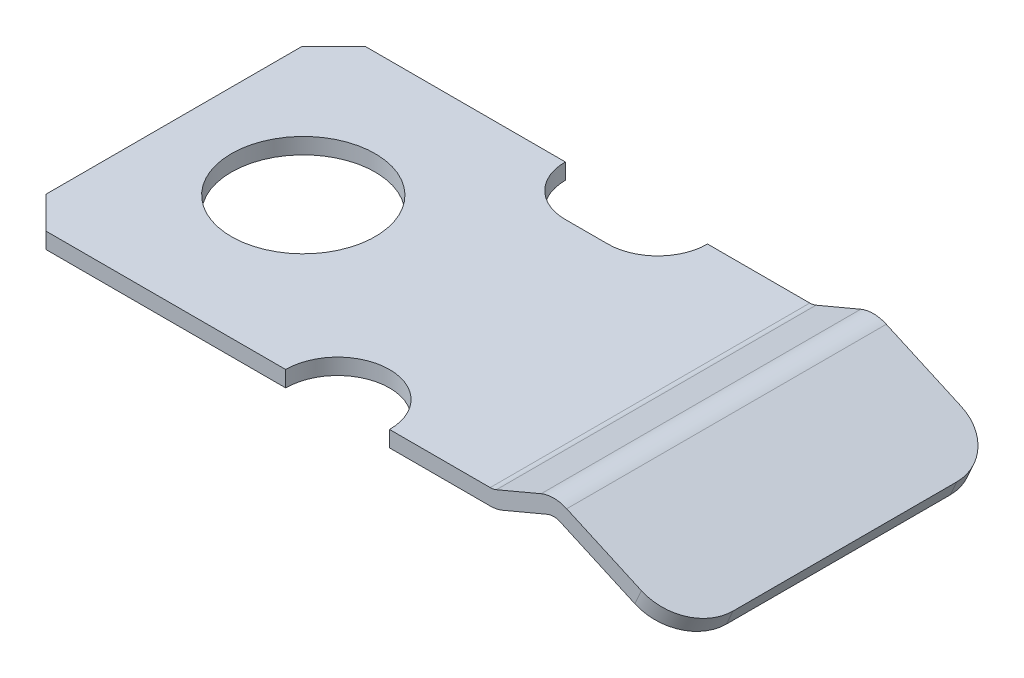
from build123d import *

# Parameters (mm, degrees)
EXTRUSION1_DEPTH        = 5
ESQUISSE2_R             = 2.25
ESQUISSE2_R_2           = 1.625
ENL_V_MAT_EXTRU_1_DEPTH = 10
CHANFREIN1_SIZE         = 1
CONG_1_R                = 1.5


with BuildPart() as part:
    # Esquisse1 → Extrusion1 (new, symmetric)
    with BuildSketch(Plane.XY):
        with BuildLine():
            Line((15.287694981, 0.078722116), (16.688265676, 0.669954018))
            ThreePointArc((16.688265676, 0.669954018), (16.888404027, 0.709282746), (17.0875962, 0.665412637))
            Line((17.0875962, 0.665412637), (20.795121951, -1))
            Line((20.795121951, -1), (21, -0.543902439))
            Line((21, -0.543902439), (17.292474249, 1.121510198))
            ThreePointArc((17.292474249, 1.121510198), (16.894089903, 1.209250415), (16.493813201, 1.13059296))
            Line((16.493813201, 1.13059296), (15.093242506, 0.539361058))
            ThreePointArc((15.093242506, 0.539361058), (14.997988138, 0.509939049), (14.898790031, 0.5))
            Line((14.898790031, 0.5), (0, 0.5))
            Line((0, 0.5), (0, 0))
            Line((0, 0), (14.898790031, 0))
            ThreePointArc((14.898790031, 0), (15.097186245, 0.019878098), (15.287694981, 0.078722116))
        make_face()
    extrude(amount=EXTRUSION1_DEPTH, both=True)

    # Esquisse2 → Enl_v. mat.-Extru.1 (cut)
    with BuildSketch(Plane(origin=(0, 0.5, 0), x_dir=(-1, 0, 0), z_dir=(0, 1, 0))):
        with Locations((-4.05, 0)):
            Circle(ESQUISSE2_R)
        with Locations((-10.125, 5)):
            Circle(ESQUISSE2_R_2)
        with BuildLine():
            Line((-10.14, -3.44), (-8.81, -3.44))
            ThreePointArc((-8.81, -3.44), (-7.706913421, -3.896913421), (-7.25, -5))
            Line((-7.25, -5), (-11.7, -5))
            ThreePointArc((-11.7, -5), (-11.243086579, -3.896913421), (-10.14, -3.44))
        make_face()
    extrude(amount=-ENL_V_MAT_EXTRU_1_DEPTH, mode=Mode.SUBTRACT)

    # Chanfrein1
    chanfrein1_edges = [part.edges().sort_by_distance(p)[0] for p in [
        (0, 0.25, -5),
        (0, 0.25, 5),
    ]]
    chamfer(chanfrein1_edges, length=CHANFREIN1_SIZE)

    # Cong_1
    cong_1_edges = [part.edges().sort_by_distance(p)[0] for p in [
        (20.897560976, -0.77195122, -5),
        (20.897560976, -0.77195122, 5),
    ]]
    fillet(cong_1_edges, radius=CONG_1_R)


solid = part.part
